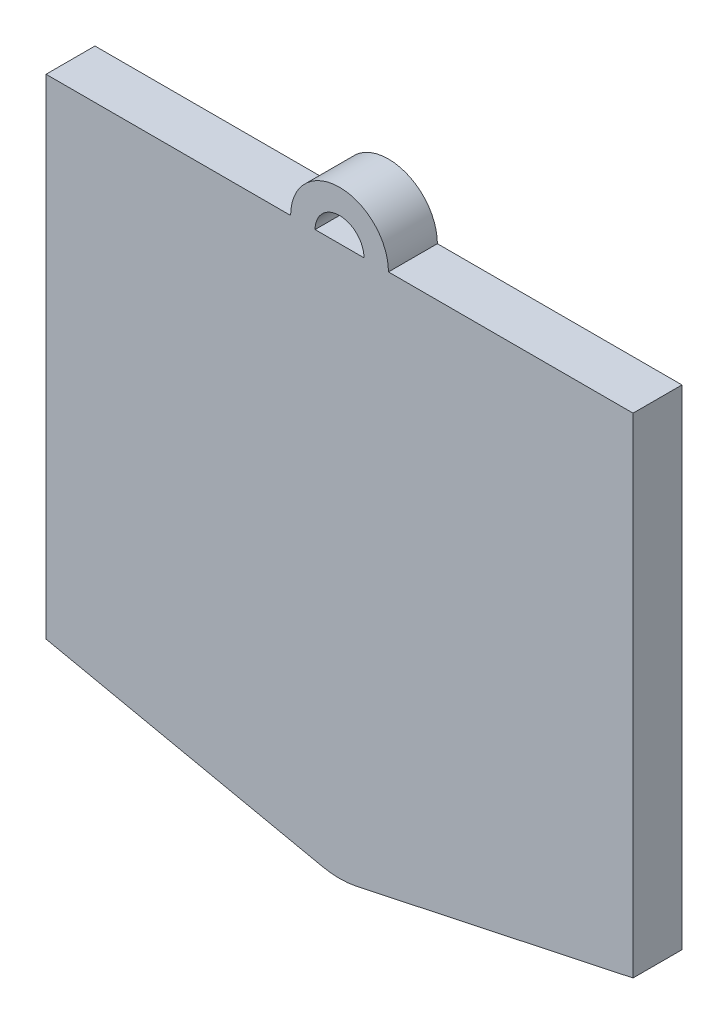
ISO-10303-21;
HEADER;
FILE_DESCRIPTION(('STEP AP214'),'2;1');
FILE_NAME('part.step','',(''),(''),'','','');
FILE_SCHEMA(('AUTOMOTIVE_DESIGN { 1 0 10303 214 1 1 1 1 }'));
ENDSEC;
DATA;
#1=APPLICATION_CONTEXT('core data for automotive mechanical design processes');
#2=APPLICATION_PROTOCOL_DEFINITION('international standard','automotive_design',2000,#1);
#3=PRODUCT_CONTEXT('',#1,'mechanical');
#4=PRODUCT('Part','Part','',(#3));
#5=PRODUCT_RELATED_PRODUCT_CATEGORY('part','',(#4));
#6=PRODUCT_DEFINITION_FORMATION('','',#4);
#7=PRODUCT_DEFINITION_CONTEXT('part definition',#1,'design');
#8=PRODUCT_DEFINITION('design','',#6,#7);
#9=PRODUCT_DEFINITION_SHAPE('','',#8);
#10=(LENGTH_UNIT() NAMED_UNIT(*) SI_UNIT(.MILLI.,.METRE.));
#11=(NAMED_UNIT(*) PLANE_ANGLE_UNIT() SI_UNIT($,.RADIAN.));
#12=(NAMED_UNIT(*) SI_UNIT($,.STERADIAN.) SOLID_ANGLE_UNIT());
#13=UNCERTAINTY_MEASURE_WITH_UNIT(LENGTH_MEASURE(1.E-05),#10,'distance_accuracy_value','');
#14=(GEOMETRIC_REPRESENTATION_CONTEXT(3) GLOBAL_UNCERTAINTY_ASSIGNED_CONTEXT((#13)) GLOBAL_UNIT_ASSIGNED_CONTEXT((#10,
#11,#12)) REPRESENTATION_CONTEXT('',''));
#15=CARTESIAN_POINT('',(0.,0.,0.));
#16=DIRECTION('',(0.,0.,1.));
#17=DIRECTION('',(1.,0.,0.));
#18=AXIS2_PLACEMENT_3D('',#15,#16,#17);
#19=CARTESIAN_POINT('',(-18.,0.,3.));
#20=DIRECTION('',(0.,-1.,0.));
#21=DIRECTION('',(0.,0.,-1.));
#22=AXIS2_PLACEMENT_3D('',#19,#20,#21);
#23=PLANE('',#22);
#24=DIRECTION('',(-1.,0.,0.));
#25=VECTOR('',#24,1.);
#26=CARTESIAN_POINT('',(-18.,0.,3.));
#27=LINE('',#26,#25);
#28=CARTESIAN_POINT('',(-3.,0.,3.));
#29=VERTEX_POINT('',#28);
#30=CARTESIAN_POINT('',(-18.,0.,3.));
#31=VERTEX_POINT('',#30);
#32=EDGE_CURVE('E50',#29,#31,#27,.T.);
#33=ORIENTED_EDGE('',*,*,#32,.F.);
#34=DIRECTION('',(0.,0.,-1.));
#35=VECTOR('',#34,1.);
#36=CARTESIAN_POINT('',(-3.,0.,9.70820393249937));
#37=LINE('',#36,#35);
#38=CARTESIAN_POINT('',(-3.,0.,0.));
#39=VERTEX_POINT('',#38);
#40=EDGE_CURVE('E138',#29,#39,#37,.T.);
#41=ORIENTED_EDGE('',*,*,#40,.T.);
#42=DIRECTION('',(-1.,0.,0.));
#43=VECTOR('',#42,1.);
#44=CARTESIAN_POINT('',(-18.,0.,0.));
#45=LINE('',#44,#43);
#46=CARTESIAN_POINT('',(-18.,0.,0.));
#47=VERTEX_POINT('',#46);
#48=EDGE_CURVE('E118',#39,#47,#45,.T.);
#49=ORIENTED_EDGE('',*,*,#48,.T.);
#50=DIRECTION('',(0.,0.,-1.));
#51=VECTOR('',#50,1.);
#52=CARTESIAN_POINT('',(-18.,0.,3.));
#53=LINE('',#52,#51);
#54=EDGE_CURVE('E156',#31,#47,#53,.T.);
#55=ORIENTED_EDGE('',*,*,#54,.F.);
#56=EDGE_LOOP('',(#33,#41,#49,#55));
#57=FACE_BOUND('',#56,.T.);
#58=ADVANCED_FACE('F35',(#57),#23,.F.);
#59=CARTESIAN_POINT('',(18.,0.,0.));
#60=VERTEX_POINT('',#59);
#61=CARTESIAN_POINT('',(3.,0.,0.));
#62=VERTEX_POINT('',#61);
#63=EDGE_CURVE('E117',#60,#62,#45,.T.);
#64=ORIENTED_EDGE('',*,*,#63,.T.);
#65=DIRECTION('',(0.,0.,-1.));
#66=VECTOR('',#65,1.);
#67=CARTESIAN_POINT('',(3.,0.,9.70820393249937));
#68=LINE('',#67,#66);
#69=CARTESIAN_POINT('',(3.,0.,3.));
#70=VERTEX_POINT('',#69);
#71=EDGE_CURVE('E127',#70,#62,#68,.T.);
#72=ORIENTED_EDGE('',*,*,#71,.F.);
#73=CARTESIAN_POINT('',(18.,0.,3.));
#74=VERTEX_POINT('',#73);
#75=EDGE_CURVE('E153',#74,#70,#27,.T.);
#76=ORIENTED_EDGE('',*,*,#75,.F.);
#77=DIRECTION('',(0.,0.,-1.));
#78=VECTOR('',#77,1.);
#79=CARTESIAN_POINT('',(18.,0.,3.));
#80=LINE('',#79,#78);
#81=EDGE_CURVE('E171',#74,#60,#80,.T.);
#82=ORIENTED_EDGE('',*,*,#81,.T.);
#83=EDGE_LOOP('',(#64,#72,#76,#82));
#84=FACE_BOUND('',#83,.T.);
#85=ADVANCED_FACE('F213',(#84),#23,.F.);
#86=CARTESIAN_POINT('',(-18.,0.,3.));
#87=DIRECTION('',(1.,0.,0.));
#88=DIRECTION('',(0.,1.,0.));
#89=AXIS2_PLACEMENT_3D('',#86,#87,#88);
#90=PLANE('',#89);
#91=DIRECTION('',(0.,-1.,0.));
#92=VECTOR('',#91,1.);
#93=CARTESIAN_POINT('',(-18.,0.,0.));
#94=LINE('',#93,#92);
#95=CARTESIAN_POINT('',(-18.,-30.,0.));
#96=VERTEX_POINT('',#95);
#97=EDGE_CURVE('E157',#47,#96,#94,.T.);
#98=ORIENTED_EDGE('',*,*,#97,.T.);
#99=DIRECTION('',(0.,0.,-1.));
#100=VECTOR('',#99,1.);
#101=CARTESIAN_POINT('',(-18.,-30.,3.));
#102=LINE('',#101,#100);
#103=CARTESIAN_POINT('',(-18.,-30.,3.));
#104=VERTEX_POINT('',#103);
#105=EDGE_CURVE('E11',#104,#96,#102,.T.);
#106=ORIENTED_EDGE('',*,*,#105,.F.);
#107=DIRECTION('',(0.,-1.,0.));
#108=VECTOR('',#107,1.);
#109=CARTESIAN_POINT('',(-18.,0.,3.));
#110=LINE('',#109,#108);
#111=EDGE_CURVE('E142',#31,#104,#110,.T.);
#112=ORIENTED_EDGE('',*,*,#111,.F.);
#113=ORIENTED_EDGE('',*,*,#54,.T.);
#114=EDGE_LOOP('',(#98,#106,#112,#113));
#115=FACE_BOUND('',#114,.T.);
#116=ADVANCED_FACE('F37',(#115),#90,.F.);
#117=CARTESIAN_POINT('',(-18.,-30.,3.));
#118=DIRECTION('',(0.208082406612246,0.978111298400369,0.));
#119=DIRECTION('',(-0.978111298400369,0.208082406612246,0.));
#120=AXIS2_PLACEMENT_3D('',#117,#118,#119);
#121=PLANE('',#120);
#122=DIRECTION('',(0.978111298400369,-0.208082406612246,0.));
#123=VECTOR('',#122,1.);
#124=CARTESIAN_POINT('',(-18.,-30.,0.));
#125=LINE('',#124,#123);
#126=CARTESIAN_POINT('',(-1.04041203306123,-33.607965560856,0.));
#127=VERTEX_POINT('',#126);
#128=EDGE_CURVE('E160',#96,#127,#125,.T.);
#129=ORIENTED_EDGE('',*,*,#128,.T.);
#130=DIRECTION('',(0.,0.,-1.));
#131=VECTOR('',#130,1.);
#132=CARTESIAN_POINT('',(-1.04041203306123,-33.607965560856,3.));
#133=LINE('',#132,#131);
#134=CARTESIAN_POINT('',(-1.04041203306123,-33.607965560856,3.));
#135=VERTEX_POINT('',#134);
#136=EDGE_CURVE('E43',#135,#127,#133,.T.);
#137=ORIENTED_EDGE('',*,*,#136,.F.);
#138=DIRECTION('',(0.978111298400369,-0.208082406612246,0.));
#139=VECTOR('',#138,1.);
#140=CARTESIAN_POINT('',(-18.,-30.,3.));
#141=LINE('',#140,#139);
#142=EDGE_CURVE('E145',#104,#135,#141,.T.);
#143=ORIENTED_EDGE('',*,*,#142,.F.);
#144=ORIENTED_EDGE('',*,*,#105,.T.);
#145=EDGE_LOOP('',(#129,#137,#143,#144));
#146=FACE_BOUND('',#145,.T.);
#147=ADVANCED_FACE('F206',(#146),#121,.F.);
#148=CARTESIAN_POINT('',(0.,-28.7174090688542,3.));
#149=DIRECTION('',(0.,0.,-1.));
#150=DIRECTION('',(-1.,0.,0.));
#151=AXIS2_PLACEMENT_3D('',#148,#149,#150);
#152=CYLINDRICAL_SURFACE('',#151,5.);
#153=CARTESIAN_POINT('',(0.,-28.7174090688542,0.));
#154=DIRECTION('',(0.,0.,1.));
#155=DIRECTION('',(-1.,0.,0.));
#156=AXIS2_PLACEMENT_3D('',#153,#154,#155);
#157=CIRCLE('',#156,5.);
#158=CARTESIAN_POINT('',(1.04041203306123,-33.607965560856,0.));
#159=VERTEX_POINT('',#158);
#160=EDGE_CURVE('E163',#127,#159,#157,.T.);
#161=ORIENTED_EDGE('',*,*,#160,.T.);
#162=DIRECTION('',(0.,0.,-1.));
#163=VECTOR('',#162,1.);
#164=CARTESIAN_POINT('',(1.04041203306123,-33.607965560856,3.));
#165=LINE('',#164,#163);
#166=CARTESIAN_POINT('',(1.04041203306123,-33.607965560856,3.));
#167=VERTEX_POINT('',#166);
#168=EDGE_CURVE('E177',#167,#159,#165,.T.);
#169=ORIENTED_EDGE('',*,*,#168,.F.);
#170=CARTESIAN_POINT('',(0.,-28.7174090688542,3.));
#171=DIRECTION('',(0.,0.,1.));
#172=DIRECTION('',(-1.,0.,0.));
#173=AXIS2_PLACEMENT_3D('',#170,#171,#172);
#174=CIRCLE('',#173,5.);
#175=EDGE_CURVE('E147',#135,#167,#174,.T.);
#176=ORIENTED_EDGE('',*,*,#175,.F.);
#177=ORIENTED_EDGE('',*,*,#136,.T.);
#178=EDGE_LOOP('',(#161,#169,#176,#177));
#179=FACE_BOUND('',#178,.T.);
#180=ADVANCED_FACE('F184',(#179),#152,.T.);
#181=CARTESIAN_POINT('',(18.,-30.,3.));
#182=DIRECTION('',(-0.208082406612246,0.978111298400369,0.));
#183=DIRECTION('',(-0.978111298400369,-0.208082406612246,0.));
#184=AXIS2_PLACEMENT_3D('',#181,#182,#183);
#185=PLANE('',#184);
#186=DIRECTION('',(0.978111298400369,0.208082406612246,0.));
#187=VECTOR('',#186,1.);
#188=CARTESIAN_POINT('',(18.,-30.,0.));
#189=LINE('',#188,#187);
#190=CARTESIAN_POINT('',(18.,-30.,0.));
#191=VERTEX_POINT('',#190);
#192=EDGE_CURVE('E165',#159,#191,#189,.T.);
#193=ORIENTED_EDGE('',*,*,#192,.T.);
#194=DIRECTION('',(0.,0.,-1.));
#195=VECTOR('',#194,1.);
#196=CARTESIAN_POINT('',(18.,-30.,3.));
#197=LINE('',#196,#195);
#198=CARTESIAN_POINT('',(18.,-30.,3.));
#199=VERTEX_POINT('',#198);
#200=EDGE_CURVE('E174',#199,#191,#197,.T.);
#201=ORIENTED_EDGE('',*,*,#200,.F.);
#202=DIRECTION('',(0.978111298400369,0.208082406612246,0.));
#203=VECTOR('',#202,1.);
#204=CARTESIAN_POINT('',(18.,-30.,3.));
#205=LINE('',#204,#203);
#206=EDGE_CURVE('E149',#167,#199,#205,.T.);
#207=ORIENTED_EDGE('',*,*,#206,.F.);
#208=ORIENTED_EDGE('',*,*,#168,.T.);
#209=EDGE_LOOP('',(#193,#201,#207,#208));
#210=FACE_BOUND('',#209,.T.);
#211=ADVANCED_FACE('F194',(#210),#185,.F.);
#212=CARTESIAN_POINT('',(18.,0.,3.));
#213=DIRECTION('',(-1.,0.,0.));
#214=DIRECTION('',(0.,-1.,0.));
#215=AXIS2_PLACEMENT_3D('',#212,#213,#214);
#216=PLANE('',#215);
#217=DIRECTION('',(0.,1.,0.));
#218=VECTOR('',#217,1.);
#219=CARTESIAN_POINT('',(18.,0.,0.));
#220=LINE('',#219,#218);
#221=EDGE_CURVE('E167',#191,#60,#220,.T.);
#222=ORIENTED_EDGE('',*,*,#221,.T.);
#223=ORIENTED_EDGE('',*,*,#81,.F.);
#224=DIRECTION('',(0.,1.,0.));
#225=VECTOR('',#224,1.);
#226=CARTESIAN_POINT('',(18.,0.,3.));
#227=LINE('',#226,#225);
#228=EDGE_CURVE('E151',#199,#74,#227,.T.);
#229=ORIENTED_EDGE('',*,*,#228,.F.);
#230=ORIENTED_EDGE('',*,*,#200,.T.);
#231=EDGE_LOOP('',(#222,#223,#229,#230));
#232=FACE_BOUND('',#231,.T.);
#233=ADVANCED_FACE('F198',(#232),#216,.F.);
#234=CARTESIAN_POINT('',(1.5,0.,0.));
#235=VERTEX_POINT('',#234);
#236=CARTESIAN_POINT('',(-1.5,0.,0.));
#237=VERTEX_POINT('',#236);
#238=EDGE_CURVE('E112',#235,#237,#45,.T.);
#239=ORIENTED_EDGE('',*,*,#238,.T.);
#240=DIRECTION('',(0.,0.,-1.));
#241=VECTOR('',#240,1.);
#242=CARTESIAN_POINT('',(-1.5,0.,9.70820393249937));
#243=LINE('',#242,#241);
#244=CARTESIAN_POINT('',(-1.5,0.,3.));
#245=VERTEX_POINT('',#244);
#246=EDGE_CURVE('E58',#245,#237,#243,.T.);
#247=ORIENTED_EDGE('',*,*,#246,.F.);
#248=CARTESIAN_POINT('',(1.5,0.,3.));
#249=VERTEX_POINT('',#248);
#250=EDGE_CURVE('E123',#249,#245,#27,.T.);
#251=ORIENTED_EDGE('',*,*,#250,.F.);
#252=DIRECTION('',(0.,0.,-1.));
#253=VECTOR('',#252,1.);
#254=CARTESIAN_POINT('',(1.5,0.,9.70820393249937));
#255=LINE('',#254,#253);
#256=EDGE_CURVE('E121',#249,#235,#255,.T.);
#257=ORIENTED_EDGE('',*,*,#256,.T.);
#258=EDGE_LOOP('',(#239,#247,#251,#257));
#259=FACE_BOUND('',#258,.T.);
#260=ADVANCED_FACE('F122',(#259),#23,.F.);
#261=CARTESIAN_POINT('',(0.,-28.7174090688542,3.));
#262=DIRECTION('',(0.,0.,-1.));
#263=DIRECTION('',(-1.,0.,0.));
#264=AXIS2_PLACEMENT_3D('',#261,#262,#263);
#265=PLANE('',#264);
#266=ORIENTED_EDGE('',*,*,#250,.T.);
#267=CARTESIAN_POINT('',(0.,0.,3.));
#268=DIRECTION('',(0.,0.,-1.));
#269=DIRECTION('',(-1.,0.,0.));
#270=AXIS2_PLACEMENT_3D('',#267,#268,#269);
#271=CIRCLE('',#270,1.5);
#272=EDGE_CURVE('E140',#245,#249,#271,.T.);
#273=ORIENTED_EDGE('',*,*,#272,.T.);
#274=EDGE_LOOP('',(#266,#273));
#275=FACE_BOUND('',#274,.T.);
#276=ORIENTED_EDGE('',*,*,#111,.T.);
#277=ORIENTED_EDGE('',*,*,#142,.T.);
#278=ORIENTED_EDGE('',*,*,#175,.T.);
#279=ORIENTED_EDGE('',*,*,#206,.T.);
#280=ORIENTED_EDGE('',*,*,#228,.T.);
#281=ORIENTED_EDGE('',*,*,#75,.T.);
#282=CARTESIAN_POINT('',(0.,0.,3.));
#283=DIRECTION('',(0.,0.,-1.));
#284=DIRECTION('',(-1.,0.,0.));
#285=AXIS2_PLACEMENT_3D('',#282,#283,#284);
#286=CIRCLE('',#285,3.);
#287=EDGE_CURVE('E161',#70,#29,#286,.F.);
#288=ORIENTED_EDGE('',*,*,#287,.T.);
#289=ORIENTED_EDGE('',*,*,#32,.T.);
#290=EDGE_LOOP('',(#276,#277,#278,#279,#280,#281,#288,#289));
#291=FACE_BOUND('',#290,.T.);
#292=ADVANCED_FACE('F202',(#275,#291),#265,.F.);
#293=CARTESIAN_POINT('',(0.,-28.7174090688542,0.));
#294=DIRECTION('',(0.,0.,-1.));
#295=DIRECTION('',(-1.,0.,0.));
#296=AXIS2_PLACEMENT_3D('',#293,#294,#295);
#297=PLANE('',#296);
#298=ORIENTED_EDGE('',*,*,#48,.F.);
#299=CARTESIAN_POINT('',(0.,0.,0.));
#300=DIRECTION('',(0.,0.,-1.));
#301=DIRECTION('',(-1.,0.,0.));
#302=AXIS2_PLACEMENT_3D('',#299,#300,#301);
#303=CIRCLE('',#302,3.);
#304=EDGE_CURVE('E130',#39,#62,#303,.T.);
#305=ORIENTED_EDGE('',*,*,#304,.T.);
#306=ORIENTED_EDGE('',*,*,#63,.F.);
#307=ORIENTED_EDGE('',*,*,#221,.F.);
#308=ORIENTED_EDGE('',*,*,#192,.F.);
#309=ORIENTED_EDGE('',*,*,#160,.F.);
#310=ORIENTED_EDGE('',*,*,#128,.F.);
#311=ORIENTED_EDGE('',*,*,#97,.F.);
#312=EDGE_LOOP('',(#298,#305,#306,#307,#308,#309,#310,#311));
#313=FACE_BOUND('',#312,.T.);
#314=CARTESIAN_POINT('',(0.,0.,0.));
#315=DIRECTION('',(0.,0.,1.));
#316=DIRECTION('',(-1.,0.,0.));
#317=AXIS2_PLACEMENT_3D('',#314,#315,#316);
#318=CIRCLE('',#317,1.5);
#319=EDGE_CURVE('E116',#235,#237,#318,.T.);
#320=ORIENTED_EDGE('',*,*,#319,.T.);
#321=ORIENTED_EDGE('',*,*,#238,.F.);
#322=EDGE_LOOP('',(#320,#321));
#323=FACE_BOUND('',#322,.T.);
#324=ADVANCED_FACE('F114',(#313,#323),#297,.T.);
#325=CARTESIAN_POINT('',(0.,0.,9.70820393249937));
#326=DIRECTION('',(0.,0.,-1.));
#327=DIRECTION('',(-1.,0.,0.));
#328=AXIS2_PLACEMENT_3D('',#325,#326,#327);
#329=CYLINDRICAL_SURFACE('',#328,3.);
#330=ORIENTED_EDGE('',*,*,#287,.F.);
#331=ORIENTED_EDGE('',*,*,#71,.T.);
#332=ORIENTED_EDGE('',*,*,#304,.F.);
#333=ORIENTED_EDGE('',*,*,#40,.F.);
#334=EDGE_LOOP('',(#330,#331,#332,#333));
#335=FACE_BOUND('',#334,.T.);
#336=ADVANCED_FACE('F211',(#335),#329,.T.);
#337=CARTESIAN_POINT('',(0.,0.,9.70820393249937));
#338=DIRECTION('',(0.,0.,-1.));
#339=DIRECTION('',(-1.,0.,0.));
#340=AXIS2_PLACEMENT_3D('',#337,#338,#339);
#341=CYLINDRICAL_SURFACE('',#340,1.5);
#342=ORIENTED_EDGE('',*,*,#272,.F.);
#343=ORIENTED_EDGE('',*,*,#246,.T.);
#344=ORIENTED_EDGE('',*,*,#319,.F.);
#345=ORIENTED_EDGE('',*,*,#256,.F.);
#346=EDGE_LOOP('',(#342,#343,#344,#345));
#347=FACE_BOUND('',#346,.T.);
#348=ADVANCED_FACE('F129',(#347),#341,.F.);
#349=CLOSED_SHELL('',(#58,#85,#116,#147,#180,#211,#233,#260,#292,#324,#336,#348));
#350=MANIFOLD_SOLID_BREP('B2',#349);
#351=ADVANCED_BREP_SHAPE_REPRESENTATION('',(#18,#350),#14);
#352=SHAPE_DEFINITION_REPRESENTATION(#9,#351);
ENDSEC;
END-ISO-10303-21;
